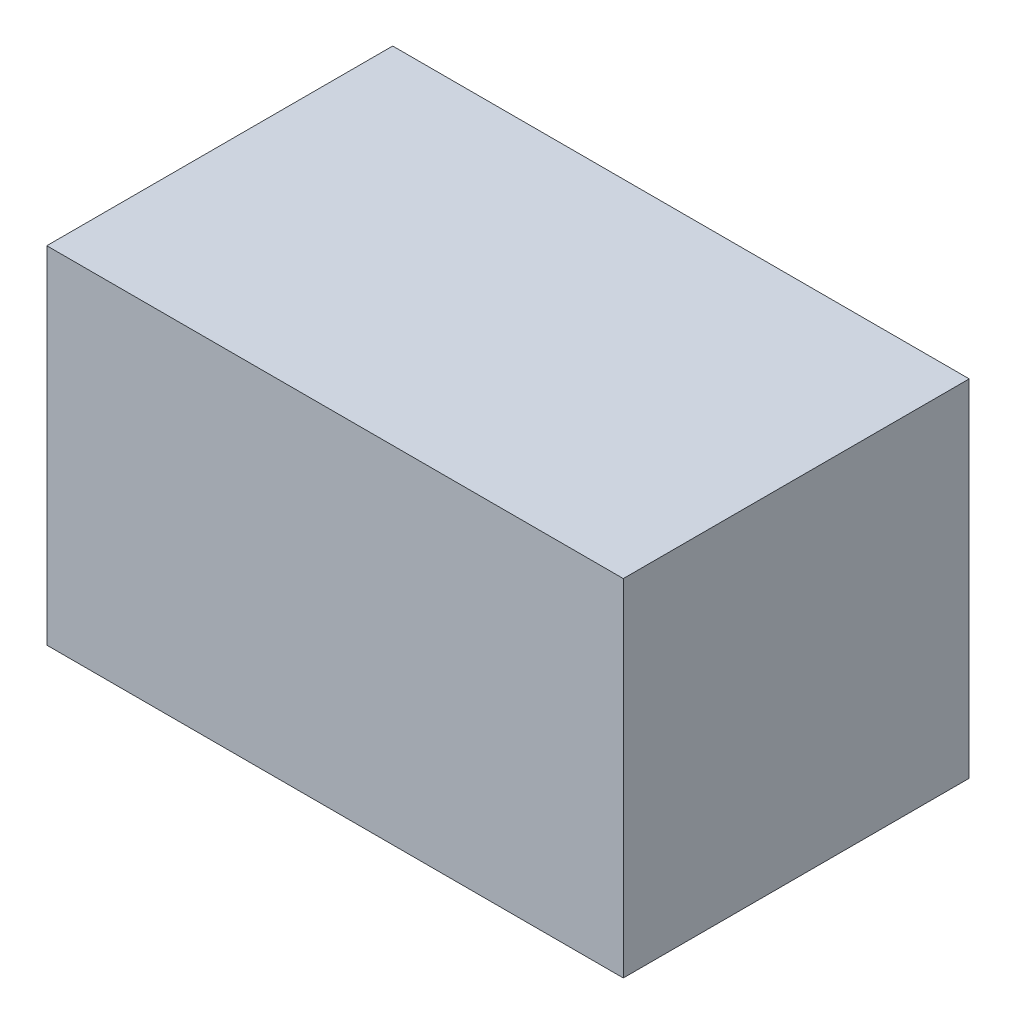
ISO-10303-21;
HEADER;
FILE_DESCRIPTION(('STEP AP214'),'2;1');
FILE_NAME('part.step','',(''),(''),'','','');
FILE_SCHEMA(('AUTOMOTIVE_DESIGN { 1 0 10303 214 1 1 1 1 }'));
ENDSEC;
DATA;
#1=APPLICATION_CONTEXT('core data for automotive mechanical design processes');
#2=APPLICATION_PROTOCOL_DEFINITION('international standard','automotive_design',2000,#1);
#3=PRODUCT_CONTEXT('',#1,'mechanical');
#4=PRODUCT('Part','Part','',(#3));
#5=PRODUCT_RELATED_PRODUCT_CATEGORY('part','',(#4));
#6=PRODUCT_DEFINITION_FORMATION('','',#4);
#7=PRODUCT_DEFINITION_CONTEXT('part definition',#1,'design');
#8=PRODUCT_DEFINITION('design','',#6,#7);
#9=PRODUCT_DEFINITION_SHAPE('','',#8);
#10=(LENGTH_UNIT() NAMED_UNIT(*) SI_UNIT(.MILLI.,.METRE.));
#11=(NAMED_UNIT(*) PLANE_ANGLE_UNIT() SI_UNIT($,.RADIAN.));
#12=(NAMED_UNIT(*) SI_UNIT($,.STERADIAN.) SOLID_ANGLE_UNIT());
#13=UNCERTAINTY_MEASURE_WITH_UNIT(LENGTH_MEASURE(1.E-05),#10,'distance_accuracy_value','');
#14=(GEOMETRIC_REPRESENTATION_CONTEXT(3) GLOBAL_UNCERTAINTY_ASSIGNED_CONTEXT((#13)) GLOBAL_UNIT_ASSIGNED_CONTEXT((#10,
#11,#12)) REPRESENTATION_CONTEXT('',''));
#15=CARTESIAN_POINT('',(0.,0.,0.));
#16=DIRECTION('',(0.,0.,1.));
#17=DIRECTION('',(1.,0.,0.));
#18=AXIS2_PLACEMENT_3D('',#15,#16,#17);
#19=CARTESIAN_POINT('',(25.,15.,15.));
#20=DIRECTION('',(-1.,0.,0.));
#21=DIRECTION('',(0.,0.,1.));
#22=AXIS2_PLACEMENT_3D('',#19,#20,#21);
#23=PLANE('',#22);
#24=DIRECTION('',(0.,0.,-1.));
#25=VECTOR('',#24,1.);
#26=CARTESIAN_POINT('',(25.,-15.,15.));
#27=LINE('',#26,#25);
#28=CARTESIAN_POINT('',(25.,-15.,15.));
#29=VERTEX_POINT('',#28);
#30=CARTESIAN_POINT('',(25.,-15.,-15.));
#31=VERTEX_POINT('',#30);
#32=EDGE_CURVE('E96',#29,#31,#27,.T.);
#33=ORIENTED_EDGE('',*,*,#32,.T.);
#34=DIRECTION('',(0.,-1.,0.));
#35=VECTOR('',#34,1.);
#36=CARTESIAN_POINT('',(25.,15.,-15.));
#37=LINE('',#36,#35);
#38=CARTESIAN_POINT('',(25.,15.,-15.));
#39=VERTEX_POINT('',#38);
#40=EDGE_CURVE('E11',#39,#31,#37,.T.);
#41=ORIENTED_EDGE('',*,*,#40,.F.);
#42=DIRECTION('',(0.,0.,-1.));
#43=VECTOR('',#42,1.);
#44=CARTESIAN_POINT('',(25.,15.,15.));
#45=LINE('',#44,#43);
#46=CARTESIAN_POINT('',(25.,15.,15.));
#47=VERTEX_POINT('',#46);
#48=EDGE_CURVE('E84',#47,#39,#45,.T.);
#49=ORIENTED_EDGE('',*,*,#48,.F.);
#50=DIRECTION('',(0.,-1.,0.));
#51=VECTOR('',#50,1.);
#52=CARTESIAN_POINT('',(25.,15.,15.));
#53=LINE('',#52,#51);
#54=EDGE_CURVE('E92',#47,#29,#53,.T.);
#55=ORIENTED_EDGE('',*,*,#54,.T.);
#56=EDGE_LOOP('',(#33,#41,#49,#55));
#57=FACE_BOUND('',#56,.T.);
#58=ADVANCED_FACE('F33',(#57),#23,.F.);
#59=CARTESIAN_POINT('',(-25.,15.,-15.));
#60=DIRECTION('',(0.,0.,1.));
#61=DIRECTION('',(1.,0.,0.));
#62=AXIS2_PLACEMENT_3D('',#59,#60,#61);
#63=PLANE('',#62);
#64=DIRECTION('',(-1.,0.,0.));
#65=VECTOR('',#64,1.);
#66=CARTESIAN_POINT('',(-25.,-15.,-15.));
#67=LINE('',#66,#65);
#68=CARTESIAN_POINT('',(-25.,-15.,-15.));
#69=VERTEX_POINT('',#68);
#70=EDGE_CURVE('E88',#31,#69,#67,.T.);
#71=ORIENTED_EDGE('',*,*,#70,.T.);
#72=DIRECTION('',(0.,-1.,0.));
#73=VECTOR('',#72,1.);
#74=CARTESIAN_POINT('',(-25.,15.,-15.));
#75=LINE('',#74,#73);
#76=CARTESIAN_POINT('',(-25.,15.,-15.));
#77=VERTEX_POINT('',#76);
#78=EDGE_CURVE('E41',#77,#69,#75,.T.);
#79=ORIENTED_EDGE('',*,*,#78,.F.);
#80=DIRECTION('',(-1.,0.,0.));
#81=VECTOR('',#80,1.);
#82=CARTESIAN_POINT('',(-25.,15.,-15.));
#83=LINE('',#82,#81);
#84=EDGE_CURVE('E79',#39,#77,#83,.T.);
#85=ORIENTED_EDGE('',*,*,#84,.F.);
#86=ORIENTED_EDGE('',*,*,#40,.T.);
#87=EDGE_LOOP('',(#71,#79,#85,#86));
#88=FACE_BOUND('',#87,.T.);
#89=ADVANCED_FACE('F87',(#88),#63,.F.);
#90=CARTESIAN_POINT('',(-25.,15.,15.));
#91=DIRECTION('',(1.,0.,0.));
#92=DIRECTION('',(0.,0.,-1.));
#93=AXIS2_PLACEMENT_3D('',#90,#91,#92);
#94=PLANE('',#93);
#95=DIRECTION('',(0.,0.,1.));
#96=VECTOR('',#95,1.);
#97=CARTESIAN_POINT('',(-25.,-15.,15.));
#98=LINE('',#97,#96);
#99=CARTESIAN_POINT('',(-25.,-15.,15.));
#100=VERTEX_POINT('',#99);
#101=EDGE_CURVE('E66',#69,#100,#98,.T.);
#102=ORIENTED_EDGE('',*,*,#101,.T.);
#103=DIRECTION('',(0.,-1.,0.));
#104=VECTOR('',#103,1.);
#105=CARTESIAN_POINT('',(-25.,15.,15.));
#106=LINE('',#105,#104);
#107=CARTESIAN_POINT('',(-25.,15.,15.));
#108=VERTEX_POINT('',#107);
#109=EDGE_CURVE('E89',#108,#100,#106,.T.);
#110=ORIENTED_EDGE('',*,*,#109,.F.);
#111=DIRECTION('',(0.,0.,1.));
#112=VECTOR('',#111,1.);
#113=CARTESIAN_POINT('',(-25.,15.,15.));
#114=LINE('',#113,#112);
#115=EDGE_CURVE('E82',#77,#108,#114,.T.);
#116=ORIENTED_EDGE('',*,*,#115,.F.);
#117=ORIENTED_EDGE('',*,*,#78,.T.);
#118=EDGE_LOOP('',(#102,#110,#116,#117));
#119=FACE_BOUND('',#118,.T.);
#120=ADVANCED_FACE('F90',(#119),#94,.F.);
#121=CARTESIAN_POINT('',(-25.,15.,15.));
#122=DIRECTION('',(0.,0.,-1.));
#123=DIRECTION('',(-1.,0.,0.));
#124=AXIS2_PLACEMENT_3D('',#121,#122,#123);
#125=PLANE('',#124);
#126=DIRECTION('',(1.,0.,0.));
#127=VECTOR('',#126,1.);
#128=CARTESIAN_POINT('',(-25.,-15.,15.));
#129=LINE('',#128,#127);
#130=EDGE_CURVE('E72',#100,#29,#129,.T.);
#131=ORIENTED_EDGE('',*,*,#130,.T.);
#132=ORIENTED_EDGE('',*,*,#54,.F.);
#133=DIRECTION('',(1.,0.,0.));
#134=VECTOR('',#133,1.);
#135=CARTESIAN_POINT('',(-25.,15.,15.));
#136=LINE('',#135,#134);
#137=EDGE_CURVE('E49',#108,#47,#136,.T.);
#138=ORIENTED_EDGE('',*,*,#137,.F.);
#139=ORIENTED_EDGE('',*,*,#109,.T.);
#140=EDGE_LOOP('',(#131,#132,#138,#139));
#141=FACE_BOUND('',#140,.T.);
#142=ADVANCED_FACE('F103',(#141),#125,.F.);
#143=CARTESIAN_POINT('',(0.,15.,0.));
#144=DIRECTION('',(0.,-1.,0.));
#145=DIRECTION('',(0.,0.,-1.));
#146=AXIS2_PLACEMENT_3D('',#143,#144,#145);
#147=PLANE('',#146);
#148=ORIENTED_EDGE('',*,*,#48,.T.);
#149=ORIENTED_EDGE('',*,*,#84,.T.);
#150=ORIENTED_EDGE('',*,*,#115,.T.);
#151=ORIENTED_EDGE('',*,*,#137,.T.);
#152=EDGE_LOOP('',(#148,#149,#150,#151));
#153=FACE_BOUND('',#152,.T.);
#154=ADVANCED_FACE('F80',(#153),#147,.F.);
#155=CARTESIAN_POINT('',(0.,-15.,0.));
#156=DIRECTION('',(0.,-1.,0.));
#157=DIRECTION('',(0.,0.,-1.));
#158=AXIS2_PLACEMENT_3D('',#155,#156,#157);
#159=PLANE('',#158);
#160=ORIENTED_EDGE('',*,*,#32,.F.);
#161=ORIENTED_EDGE('',*,*,#130,.F.);
#162=ORIENTED_EDGE('',*,*,#101,.F.);
#163=ORIENTED_EDGE('',*,*,#70,.F.);
#164=EDGE_LOOP('',(#160,#161,#162,#163));
#165=FACE_BOUND('',#164,.T.);
#166=ADVANCED_FACE('F106',(#165),#159,.T.);
#167=CLOSED_SHELL('',(#58,#89,#120,#142,#154,#166));
#168=MANIFOLD_SOLID_BREP('B2',#167);
#169=ADVANCED_BREP_SHAPE_REPRESENTATION('',(#18,#168),#14);
#170=SHAPE_DEFINITION_REPRESENTATION(#9,#169);
ENDSEC;
END-ISO-10303-21;
